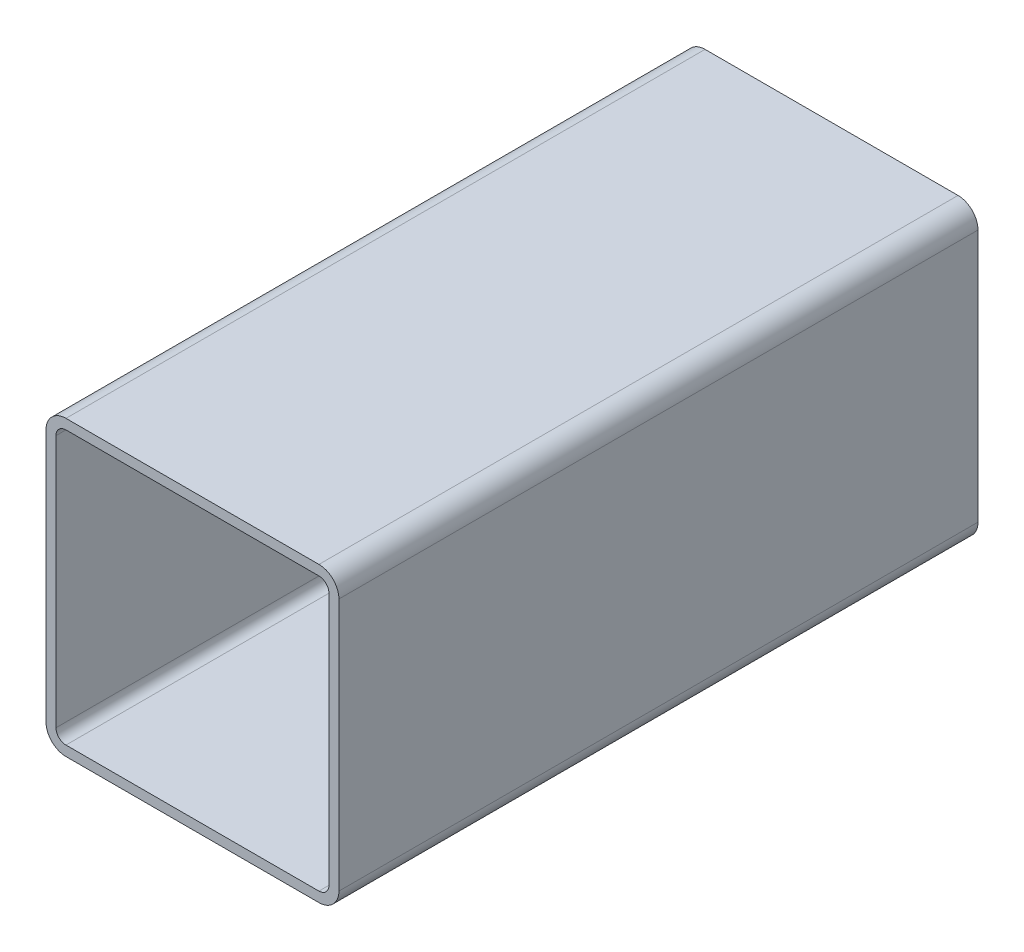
ISO-10303-21;
HEADER;
FILE_DESCRIPTION(('STEP AP214'),'2;1');
FILE_NAME('part.step','',(''),(''),'','','');
FILE_SCHEMA(('AUTOMOTIVE_DESIGN { 1 0 10303 214 1 1 1 1 }'));
ENDSEC;
DATA;
#1=APPLICATION_CONTEXT('core data for automotive mechanical design processes');
#2=APPLICATION_PROTOCOL_DEFINITION('international standard','automotive_design',2000,#1);
#3=PRODUCT_CONTEXT('',#1,'mechanical');
#4=PRODUCT('Part','Part','',(#3));
#5=PRODUCT_RELATED_PRODUCT_CATEGORY('part','',(#4));
#6=PRODUCT_DEFINITION_FORMATION('','',#4);
#7=PRODUCT_DEFINITION_CONTEXT('part definition',#1,'design');
#8=PRODUCT_DEFINITION('design','',#6,#7);
#9=PRODUCT_DEFINITION_SHAPE('','',#8);
#10=(LENGTH_UNIT() NAMED_UNIT(*) SI_UNIT(.MILLI.,.METRE.));
#11=(NAMED_UNIT(*) PLANE_ANGLE_UNIT() SI_UNIT($,.RADIAN.));
#12=(NAMED_UNIT(*) SI_UNIT($,.STERADIAN.) SOLID_ANGLE_UNIT());
#13=UNCERTAINTY_MEASURE_WITH_UNIT(LENGTH_MEASURE(1.E-05),#10,'distance_accuracy_value','');
#14=(GEOMETRIC_REPRESENTATION_CONTEXT(3) GLOBAL_UNCERTAINTY_ASSIGNED_CONTEXT((#13)) GLOBAL_UNIT_ASSIGNED_CONTEXT((#10,
#11,#12)) REPRESENTATION_CONTEXT('',''));
#15=CARTESIAN_POINT('',(0.,0.,0.));
#16=DIRECTION('',(0.,0.,1.));
#17=DIRECTION('',(1.,0.,0.));
#18=AXIS2_PLACEMENT_3D('',#15,#16,#17);
#19=CARTESIAN_POINT('',(9.97927050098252,130.930693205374,304.8));
#20=DIRECTION('',(0.,0.,1.));
#21=DIRECTION('',(1.,0.,0.));
#22=AXIS2_PLACEMENT_3D('',#19,#20,#21);
#23=PLANE('',#22);
#24=CARTESIAN_POINT('',(9.97927050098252,130.930693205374,304.8));
#25=DIRECTION('',(0.,0.,1.));
#26=DIRECTION('',(1.,0.,0.));
#27=AXIS2_PLACEMENT_3D('',#24,#25,#26);
#28=CIRCLE('',#27,9.52500000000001);
#29=CARTESIAN_POINT('',(9.97927050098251,140.455693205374,304.8));
#30=VERTEX_POINT('',#29);
#31=CARTESIAN_POINT('',(0.454270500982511,130.930693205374,304.8));
#32=VERTEX_POINT('',#31);
#33=EDGE_CURVE('E211',#30,#32,#28,.T.);
#34=ORIENTED_EDGE('',*,*,#33,.T.);
#35=DIRECTION('',(0.,-1.,0.));
#36=VECTOR('',#35,1.);
#37=CARTESIAN_POINT('',(0.454270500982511,130.930693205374,304.8));
#38=LINE('',#37,#36);
#39=CARTESIAN_POINT('',(0.45427050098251,10.2806932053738,304.8));
#40=VERTEX_POINT('',#39);
#41=EDGE_CURVE('E214',#32,#40,#38,.T.);
#42=ORIENTED_EDGE('',*,*,#41,.T.);
#43=CARTESIAN_POINT('',(9.97927050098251,10.2806932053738,304.8));
#44=DIRECTION('',(0.,0.,1.));
#45=DIRECTION('',(1.,0.,0.));
#46=AXIS2_PLACEMENT_3D('',#43,#44,#45);
#47=CIRCLE('',#46,9.525);
#48=CARTESIAN_POINT('',(9.97927050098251,0.755693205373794,304.8));
#49=VERTEX_POINT('',#48);
#50=EDGE_CURVE('E217',#40,#49,#47,.T.);
#51=ORIENTED_EDGE('',*,*,#50,.T.);
#52=DIRECTION('',(1.,0.,0.));
#53=VECTOR('',#52,1.);
#54=CARTESIAN_POINT('',(9.97927050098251,0.755693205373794,304.8));
#55=LINE('',#54,#53);
#56=CARTESIAN_POINT('',(130.629270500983,0.755693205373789,304.8));
#57=VERTEX_POINT('',#56);
#58=EDGE_CURVE('E219',#49,#57,#55,.T.);
#59=ORIENTED_EDGE('',*,*,#58,.T.);
#60=CARTESIAN_POINT('',(130.629270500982,10.2806932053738,304.8));
#61=DIRECTION('',(0.,0.,1.));
#62=DIRECTION('',(1.,0.,0.));
#63=AXIS2_PLACEMENT_3D('',#60,#61,#62);
#64=CIRCLE('',#63,9.525);
#65=CARTESIAN_POINT('',(140.154270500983,10.2806932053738,304.8));
#66=VERTEX_POINT('',#65);
#67=EDGE_CURVE('E221',#57,#66,#64,.T.);
#68=ORIENTED_EDGE('',*,*,#67,.T.);
#69=DIRECTION('',(0.,1.,0.));
#70=VECTOR('',#69,1.);
#71=CARTESIAN_POINT('',(140.154270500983,10.2806932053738,304.8));
#72=LINE('',#71,#70);
#73=CARTESIAN_POINT('',(140.154270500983,130.930693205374,304.8));
#74=VERTEX_POINT('',#73);
#75=EDGE_CURVE('E223',#66,#74,#72,.T.);
#76=ORIENTED_EDGE('',*,*,#75,.T.);
#77=CARTESIAN_POINT('',(130.629270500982,130.930693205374,304.8));
#78=DIRECTION('',(0.,0.,1.));
#79=DIRECTION('',(1.,0.,0.));
#80=AXIS2_PLACEMENT_3D('',#77,#78,#79);
#81=CIRCLE('',#80,9.52500000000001);
#82=CARTESIAN_POINT('',(130.629270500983,140.455693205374,304.8));
#83=VERTEX_POINT('',#82);
#84=EDGE_CURVE('E225',#74,#83,#81,.T.);
#85=ORIENTED_EDGE('',*,*,#84,.T.);
#86=DIRECTION('',(-1.,0.,0.));
#87=VECTOR('',#86,1.);
#88=CARTESIAN_POINT('',(130.629270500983,140.455693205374,304.8));
#89=LINE('',#88,#87);
#90=EDGE_CURVE('E227',#83,#30,#89,.T.);
#91=ORIENTED_EDGE('',*,*,#90,.T.);
#92=EDGE_LOOP('',(#34,#42,#51,#59,#68,#76,#85,#91));
#93=FACE_BOUND('',#92,.T.);
#94=DIRECTION('',(0.,-1.,0.));
#95=VECTOR('',#94,1.);
#96=CARTESIAN_POINT('',(5.21677050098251,10.2806932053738,304.8));
#97=LINE('',#96,#95);
#98=CARTESIAN_POINT('',(5.21677050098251,130.930693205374,304.8));
#99=VERTEX_POINT('',#98);
#100=CARTESIAN_POINT('',(5.21677050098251,10.2806932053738,304.8));
#101=VERTEX_POINT('',#100);
#102=EDGE_CURVE('E154',#99,#101,#97,.T.);
#103=ORIENTED_EDGE('',*,*,#102,.F.);
#104=CARTESIAN_POINT('',(9.97927050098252,130.930693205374,304.8));
#105=DIRECTION('',(0.,0.,1.));
#106=DIRECTION('',(1.,0.,0.));
#107=AXIS2_PLACEMENT_3D('',#104,#105,#106);
#108=CIRCLE('',#107,4.7625);
#109=CARTESIAN_POINT('',(9.97927050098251,135.693193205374,304.8));
#110=VERTEX_POINT('',#109);
#111=EDGE_CURVE('E146',#110,#99,#108,.T.);
#112=ORIENTED_EDGE('',*,*,#111,.F.);
#113=DIRECTION('',(-1.,0.,0.));
#114=VECTOR('',#113,1.);
#115=CARTESIAN_POINT('',(9.97927050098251,135.693193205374,304.8));
#116=LINE('',#115,#114);
#117=CARTESIAN_POINT('',(130.629270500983,135.693193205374,304.8));
#118=VERTEX_POINT('',#117);
#119=EDGE_CURVE('E179',#118,#110,#116,.T.);
#120=ORIENTED_EDGE('',*,*,#119,.F.);
#121=CARTESIAN_POINT('',(130.629270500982,130.930693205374,304.8));
#122=DIRECTION('',(0.,0.,1.));
#123=DIRECTION('',(1.,0.,0.));
#124=AXIS2_PLACEMENT_3D('',#121,#122,#123);
#125=CIRCLE('',#124,4.7625);
#126=CARTESIAN_POINT('',(135.391770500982,130.930693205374,304.8));
#127=VERTEX_POINT('',#126);
#128=EDGE_CURVE('E177',#127,#118,#125,.T.);
#129=ORIENTED_EDGE('',*,*,#128,.F.);
#130=DIRECTION('',(0.,1.,0.));
#131=VECTOR('',#130,1.);
#132=CARTESIAN_POINT('',(135.391770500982,130.930693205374,304.8));
#133=LINE('',#132,#131);
#134=CARTESIAN_POINT('',(135.391770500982,10.2806932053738,304.8));
#135=VERTEX_POINT('',#134);
#136=EDGE_CURVE('E175',#135,#127,#133,.T.);
#137=ORIENTED_EDGE('',*,*,#136,.F.);
#138=CARTESIAN_POINT('',(130.629270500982,10.2806932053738,304.8));
#139=DIRECTION('',(0.,0.,1.));
#140=DIRECTION('',(1.,0.,0.));
#141=AXIS2_PLACEMENT_3D('',#138,#139,#140);
#142=CIRCLE('',#141,4.7625);
#143=CARTESIAN_POINT('',(130.629270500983,5.51819320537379,304.8));
#144=VERTEX_POINT('',#143);
#145=EDGE_CURVE('E173',#144,#135,#142,.T.);
#146=ORIENTED_EDGE('',*,*,#145,.F.);
#147=DIRECTION('',(1.,0.,0.));
#148=VECTOR('',#147,1.);
#149=CARTESIAN_POINT('',(130.629270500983,5.51819320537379,304.8));
#150=LINE('',#149,#148);
#151=CARTESIAN_POINT('',(9.97927050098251,5.51819320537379,304.8));
#152=VERTEX_POINT('',#151);
#153=EDGE_CURVE('E169',#152,#144,#150,.T.);
#154=ORIENTED_EDGE('',*,*,#153,.F.);
#155=CARTESIAN_POINT('',(9.97927050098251,10.2806932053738,304.8));
#156=DIRECTION('',(0.,0.,1.));
#157=DIRECTION('',(1.,0.,0.));
#158=AXIS2_PLACEMENT_3D('',#155,#156,#157);
#159=CIRCLE('',#158,4.7625);
#160=EDGE_CURVE('E167',#101,#152,#159,.T.);
#161=ORIENTED_EDGE('',*,*,#160,.F.);
#162=EDGE_LOOP('',(#103,#112,#120,#129,#137,#146,#154,#161));
#163=FACE_BOUND('',#162,.T.);
#164=ADVANCED_FACE('F33',(#93,#163),#23,.T.);
#165=CARTESIAN_POINT('',(9.97927050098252,130.930693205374,0.));
#166=DIRECTION('',(0.,0.,1.));
#167=DIRECTION('',(1.,0.,0.));
#168=AXIS2_PLACEMENT_3D('',#165,#166,#167);
#169=PLANE('',#168);
#170=CARTESIAN_POINT('',(9.97927050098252,130.930693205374,0.));
#171=DIRECTION('',(0.,0.,1.));
#172=DIRECTION('',(1.,0.,0.));
#173=AXIS2_PLACEMENT_3D('',#170,#171,#172);
#174=CIRCLE('',#173,9.52500000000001);
#175=CARTESIAN_POINT('',(9.97927050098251,140.455693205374,0.));
#176=VERTEX_POINT('',#175);
#177=CARTESIAN_POINT('',(0.454270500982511,130.930693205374,0.));
#178=VERTEX_POINT('',#177);
#179=EDGE_CURVE('E162',#176,#178,#174,.T.);
#180=ORIENTED_EDGE('',*,*,#179,.F.);
#181=DIRECTION('',(-1.,0.,0.));
#182=VECTOR('',#181,1.);
#183=CARTESIAN_POINT('',(130.629270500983,140.455693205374,0.));
#184=LINE('',#183,#182);
#185=CARTESIAN_POINT('',(130.629270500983,140.455693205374,0.));
#186=VERTEX_POINT('',#185);
#187=EDGE_CURVE('E215',#186,#176,#184,.T.);
#188=ORIENTED_EDGE('',*,*,#187,.F.);
#189=CARTESIAN_POINT('',(130.629270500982,130.930693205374,0.));
#190=DIRECTION('',(0.,0.,1.));
#191=DIRECTION('',(1.,0.,0.));
#192=AXIS2_PLACEMENT_3D('',#189,#190,#191);
#193=CIRCLE('',#192,9.52500000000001);
#194=CARTESIAN_POINT('',(140.154270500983,130.930693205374,0.));
#195=VERTEX_POINT('',#194);
#196=EDGE_CURVE('E242',#195,#186,#193,.T.);
#197=ORIENTED_EDGE('',*,*,#196,.F.);
#198=DIRECTION('',(0.,1.,0.));
#199=VECTOR('',#198,1.);
#200=CARTESIAN_POINT('',(140.154270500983,10.2806932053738,0.));
#201=LINE('',#200,#199);
#202=CARTESIAN_POINT('',(140.154270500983,10.2806932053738,0.));
#203=VERTEX_POINT('',#202);
#204=EDGE_CURVE('E240',#203,#195,#201,.T.);
#205=ORIENTED_EDGE('',*,*,#204,.F.);
#206=CARTESIAN_POINT('',(130.629270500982,10.2806932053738,0.));
#207=DIRECTION('',(0.,0.,1.));
#208=DIRECTION('',(1.,0.,0.));
#209=AXIS2_PLACEMENT_3D('',#206,#207,#208);
#210=CIRCLE('',#209,9.525);
#211=CARTESIAN_POINT('',(130.629270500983,0.755693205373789,0.));
#212=VERTEX_POINT('',#211);
#213=EDGE_CURVE('E238',#212,#203,#210,.T.);
#214=ORIENTED_EDGE('',*,*,#213,.F.);
#215=DIRECTION('',(1.,0.,0.));
#216=VECTOR('',#215,1.);
#217=CARTESIAN_POINT('',(9.97927050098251,0.755693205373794,0.));
#218=LINE('',#217,#216);
#219=CARTESIAN_POINT('',(9.97927050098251,0.755693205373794,0.));
#220=VERTEX_POINT('',#219);
#221=EDGE_CURVE('E236',#220,#212,#218,.T.);
#222=ORIENTED_EDGE('',*,*,#221,.F.);
#223=CARTESIAN_POINT('',(9.97927050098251,10.2806932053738,0.));
#224=DIRECTION('',(0.,0.,1.));
#225=DIRECTION('',(1.,0.,0.));
#226=AXIS2_PLACEMENT_3D('',#223,#224,#225);
#227=CIRCLE('',#226,9.525);
#228=CARTESIAN_POINT('',(0.45427050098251,10.2806932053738,0.));
#229=VERTEX_POINT('',#228);
#230=EDGE_CURVE('E234',#229,#220,#227,.T.);
#231=ORIENTED_EDGE('',*,*,#230,.F.);
#232=DIRECTION('',(0.,-1.,0.));
#233=VECTOR('',#232,1.);
#234=CARTESIAN_POINT('',(0.454270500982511,130.930693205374,0.));
#235=LINE('',#234,#233);
#236=EDGE_CURVE('E232',#178,#229,#235,.T.);
#237=ORIENTED_EDGE('',*,*,#236,.F.);
#238=EDGE_LOOP('',(#180,#188,#197,#205,#214,#222,#231,#237));
#239=FACE_BOUND('',#238,.T.);
#240=CARTESIAN_POINT('',(9.97927050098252,130.930693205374,0.));
#241=DIRECTION('',(0.,0.,1.));
#242=DIRECTION('',(1.,0.,0.));
#243=AXIS2_PLACEMENT_3D('',#240,#241,#242);
#244=CIRCLE('',#243,4.7625);
#245=CARTESIAN_POINT('',(9.97927050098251,135.693193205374,0.));
#246=VERTEX_POINT('',#245);
#247=CARTESIAN_POINT('',(5.21677050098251,130.930693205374,0.));
#248=VERTEX_POINT('',#247);
#249=EDGE_CURVE('E56',#246,#248,#244,.T.);
#250=ORIENTED_EDGE('',*,*,#249,.T.);
#251=DIRECTION('',(0.,-1.,0.));
#252=VECTOR('',#251,1.);
#253=CARTESIAN_POINT('',(5.21677050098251,10.2806932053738,0.));
#254=LINE('',#253,#252);
#255=CARTESIAN_POINT('',(5.21677050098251,10.2806932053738,0.));
#256=VERTEX_POINT('',#255);
#257=EDGE_CURVE('E161',#248,#256,#254,.T.);
#258=ORIENTED_EDGE('',*,*,#257,.T.);
#259=CARTESIAN_POINT('',(9.97927050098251,10.2806932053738,0.));
#260=DIRECTION('',(0.,0.,1.));
#261=DIRECTION('',(1.,0.,0.));
#262=AXIS2_PLACEMENT_3D('',#259,#260,#261);
#263=CIRCLE('',#262,4.7625);
#264=CARTESIAN_POINT('',(9.97927050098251,5.51819320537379,0.));
#265=VERTEX_POINT('',#264);
#266=EDGE_CURVE('E183',#256,#265,#263,.T.);
#267=ORIENTED_EDGE('',*,*,#266,.T.);
#268=DIRECTION('',(1.,0.,0.));
#269=VECTOR('',#268,1.);
#270=CARTESIAN_POINT('',(130.629270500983,5.51819320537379,0.));
#271=LINE('',#270,#269);
#272=CARTESIAN_POINT('',(130.629270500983,5.51819320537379,0.));
#273=VERTEX_POINT('',#272);
#274=EDGE_CURVE('E186',#265,#273,#271,.T.);
#275=ORIENTED_EDGE('',*,*,#274,.T.);
#276=CARTESIAN_POINT('',(130.629270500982,10.2806932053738,0.));
#277=DIRECTION('',(0.,0.,1.));
#278=DIRECTION('',(1.,0.,0.));
#279=AXIS2_PLACEMENT_3D('',#276,#277,#278);
#280=CIRCLE('',#279,4.7625);
#281=CARTESIAN_POINT('',(135.391770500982,10.2806932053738,0.));
#282=VERTEX_POINT('',#281);
#283=EDGE_CURVE('E189',#273,#282,#280,.T.);
#284=ORIENTED_EDGE('',*,*,#283,.T.);
#285=DIRECTION('',(0.,1.,0.));
#286=VECTOR('',#285,1.);
#287=CARTESIAN_POINT('',(135.391770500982,130.930693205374,0.));
#288=LINE('',#287,#286);
#289=CARTESIAN_POINT('',(135.391770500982,130.930693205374,0.));
#290=VERTEX_POINT('',#289);
#291=EDGE_CURVE('E192',#282,#290,#288,.T.);
#292=ORIENTED_EDGE('',*,*,#291,.T.);
#293=CARTESIAN_POINT('',(130.629270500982,130.930693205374,0.));
#294=DIRECTION('',(0.,0.,1.));
#295=DIRECTION('',(1.,0.,0.));
#296=AXIS2_PLACEMENT_3D('',#293,#294,#295);
#297=CIRCLE('',#296,4.7625);
#298=CARTESIAN_POINT('',(130.629270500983,135.693193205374,0.));
#299=VERTEX_POINT('',#298);
#300=EDGE_CURVE('E195',#290,#299,#297,.T.);
#301=ORIENTED_EDGE('',*,*,#300,.T.);
#302=DIRECTION('',(-1.,0.,0.));
#303=VECTOR('',#302,1.);
#304=CARTESIAN_POINT('',(9.97927050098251,135.693193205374,0.));
#305=LINE('',#304,#303);
#306=EDGE_CURVE('E155',#299,#246,#305,.T.);
#307=ORIENTED_EDGE('',*,*,#306,.T.);
#308=EDGE_LOOP('',(#250,#258,#267,#275,#284,#292,#301,#307));
#309=FACE_BOUND('',#308,.T.);
#310=ADVANCED_FACE('F272',(#239,#309),#169,.F.);
#311=CARTESIAN_POINT('',(9.97927050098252,130.930693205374,304.8));
#312=DIRECTION('',(0.,0.,-1.));
#313=DIRECTION('',(-1.,0.,0.));
#314=AXIS2_PLACEMENT_3D('',#311,#312,#313);
#315=CYLINDRICAL_SURFACE('',#314,9.52500000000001);
#316=ORIENTED_EDGE('',*,*,#179,.T.);
#317=DIRECTION('',(0.,0.,-1.));
#318=VECTOR('',#317,1.);
#319=CARTESIAN_POINT('',(0.454270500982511,130.930693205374,304.8));
#320=LINE('',#319,#318);
#321=EDGE_CURVE('E11',#32,#178,#320,.T.);
#322=ORIENTED_EDGE('',*,*,#321,.F.);
#323=ORIENTED_EDGE('',*,*,#33,.F.);
#324=DIRECTION('',(0.,0.,-1.));
#325=VECTOR('',#324,1.);
#326=CARTESIAN_POINT('',(9.97927050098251,140.455693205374,304.8));
#327=LINE('',#326,#325);
#328=EDGE_CURVE('E229',#30,#176,#327,.T.);
#329=ORIENTED_EDGE('',*,*,#328,.T.);
#330=EDGE_LOOP('',(#316,#322,#323,#329));
#331=FACE_BOUND('',#330,.T.);
#332=ADVANCED_FACE('F35',(#331),#315,.T.);
#333=CARTESIAN_POINT('',(0.454270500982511,130.930693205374,304.8));
#334=DIRECTION('',(1.,0.,0.));
#335=DIRECTION('',(0.,0.,-1.));
#336=AXIS2_PLACEMENT_3D('',#333,#334,#335);
#337=PLANE('',#336);
#338=ORIENTED_EDGE('',*,*,#236,.T.);
#339=DIRECTION('',(0.,0.,-1.));
#340=VECTOR('',#339,1.);
#341=CARTESIAN_POINT('',(0.45427050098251,10.2806932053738,304.8));
#342=LINE('',#341,#340);
#343=EDGE_CURVE('E41',#40,#229,#342,.T.);
#344=ORIENTED_EDGE('',*,*,#343,.F.);
#345=ORIENTED_EDGE('',*,*,#41,.F.);
#346=ORIENTED_EDGE('',*,*,#321,.T.);
#347=EDGE_LOOP('',(#338,#344,#345,#346));
#348=FACE_BOUND('',#347,.T.);
#349=ADVANCED_FACE('F289',(#348),#337,.F.);
#350=CARTESIAN_POINT('',(9.97927050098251,10.2806932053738,304.8));
#351=DIRECTION('',(0.,0.,-1.));
#352=DIRECTION('',(-1.,0.,0.));
#353=AXIS2_PLACEMENT_3D('',#350,#351,#352);
#354=CYLINDRICAL_SURFACE('',#353,9.525);
#355=ORIENTED_EDGE('',*,*,#230,.T.);
#356=DIRECTION('',(0.,0.,-1.));
#357=VECTOR('',#356,1.);
#358=CARTESIAN_POINT('',(9.97927050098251,0.755693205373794,304.8));
#359=LINE('',#358,#357);
#360=EDGE_CURVE('E259',#49,#220,#359,.T.);
#361=ORIENTED_EDGE('',*,*,#360,.F.);
#362=ORIENTED_EDGE('',*,*,#50,.F.);
#363=ORIENTED_EDGE('',*,*,#343,.T.);
#364=EDGE_LOOP('',(#355,#361,#362,#363));
#365=FACE_BOUND('',#364,.T.);
#366=ADVANCED_FACE('F266',(#365),#354,.T.);
#367=CARTESIAN_POINT('',(9.97927050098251,0.755693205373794,304.8));
#368=DIRECTION('',(0.,1.,0.));
#369=DIRECTION('',(0.,0.,1.));
#370=AXIS2_PLACEMENT_3D('',#367,#368,#369);
#371=PLANE('',#370);
#372=ORIENTED_EDGE('',*,*,#221,.T.);
#373=DIRECTION('',(0.,0.,-1.));
#374=VECTOR('',#373,1.);
#375=CARTESIAN_POINT('',(130.629270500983,0.755693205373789,304.8));
#376=LINE('',#375,#374);
#377=EDGE_CURVE('E256',#57,#212,#376,.T.);
#378=ORIENTED_EDGE('',*,*,#377,.F.);
#379=ORIENTED_EDGE('',*,*,#58,.F.);
#380=ORIENTED_EDGE('',*,*,#360,.T.);
#381=EDGE_LOOP('',(#372,#378,#379,#380));
#382=FACE_BOUND('',#381,.T.);
#383=ADVANCED_FACE('F278',(#382),#371,.F.);
#384=CARTESIAN_POINT('',(130.629270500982,10.2806932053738,304.8));
#385=DIRECTION('',(0.,0.,-1.));
#386=DIRECTION('',(-1.,0.,0.));
#387=AXIS2_PLACEMENT_3D('',#384,#385,#386);
#388=CYLINDRICAL_SURFACE('',#387,9.525);
#389=ORIENTED_EDGE('',*,*,#213,.T.);
#390=DIRECTION('',(0.,0.,-1.));
#391=VECTOR('',#390,1.);
#392=CARTESIAN_POINT('',(140.154270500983,10.2806932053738,304.8));
#393=LINE('',#392,#391);
#394=EDGE_CURVE('E253',#66,#203,#393,.T.);
#395=ORIENTED_EDGE('',*,*,#394,.F.);
#396=ORIENTED_EDGE('',*,*,#67,.F.);
#397=ORIENTED_EDGE('',*,*,#377,.T.);
#398=EDGE_LOOP('',(#389,#395,#396,#397));
#399=FACE_BOUND('',#398,.T.);
#400=ADVANCED_FACE('F282',(#399),#388,.T.);
#401=CARTESIAN_POINT('',(140.154270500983,10.2806932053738,304.8));
#402=DIRECTION('',(-1.,0.,0.));
#403=DIRECTION('',(0.,0.,1.));
#404=AXIS2_PLACEMENT_3D('',#401,#402,#403);
#405=PLANE('',#404);
#406=ORIENTED_EDGE('',*,*,#204,.T.);
#407=DIRECTION('',(0.,0.,-1.));
#408=VECTOR('',#407,1.);
#409=CARTESIAN_POINT('',(140.154270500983,130.930693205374,304.8));
#410=LINE('',#409,#408);
#411=EDGE_CURVE('E250',#74,#195,#410,.T.);
#412=ORIENTED_EDGE('',*,*,#411,.F.);
#413=ORIENTED_EDGE('',*,*,#75,.F.);
#414=ORIENTED_EDGE('',*,*,#394,.T.);
#415=EDGE_LOOP('',(#406,#412,#413,#414));
#416=FACE_BOUND('',#415,.T.);
#417=ADVANCED_FACE('F302',(#416),#405,.F.);
#418=CARTESIAN_POINT('',(130.629270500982,130.930693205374,304.8));
#419=DIRECTION('',(0.,0.,-1.));
#420=DIRECTION('',(-1.,0.,0.));
#421=AXIS2_PLACEMENT_3D('',#418,#419,#420);
#422=CYLINDRICAL_SURFACE('',#421,9.52500000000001);
#423=ORIENTED_EDGE('',*,*,#196,.T.);
#424=DIRECTION('',(0.,0.,-1.));
#425=VECTOR('',#424,1.);
#426=CARTESIAN_POINT('',(130.629270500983,140.455693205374,304.8));
#427=LINE('',#426,#425);
#428=EDGE_CURVE('E247',#83,#186,#427,.T.);
#429=ORIENTED_EDGE('',*,*,#428,.F.);
#430=ORIENTED_EDGE('',*,*,#84,.F.);
#431=ORIENTED_EDGE('',*,*,#411,.T.);
#432=EDGE_LOOP('',(#423,#429,#430,#431));
#433=FACE_BOUND('',#432,.T.);
#434=ADVANCED_FACE('F300',(#433),#422,.T.);
#435=CARTESIAN_POINT('',(130.629270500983,140.455693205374,304.8));
#436=DIRECTION('',(0.,-1.,0.));
#437=DIRECTION('',(0.,0.,-1.));
#438=AXIS2_PLACEMENT_3D('',#435,#436,#437);
#439=PLANE('',#438);
#440=ORIENTED_EDGE('',*,*,#187,.T.);
#441=ORIENTED_EDGE('',*,*,#328,.F.);
#442=ORIENTED_EDGE('',*,*,#90,.F.);
#443=ORIENTED_EDGE('',*,*,#428,.T.);
#444=EDGE_LOOP('',(#440,#441,#442,#443));
#445=FACE_BOUND('',#444,.T.);
#446=ADVANCED_FACE('F295',(#445),#439,.F.);
#447=CARTESIAN_POINT('',(9.97927050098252,130.930693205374,304.8));
#448=DIRECTION('',(0.,0.,-1.));
#449=DIRECTION('',(-1.,0.,0.));
#450=AXIS2_PLACEMENT_3D('',#447,#448,#449);
#451=CYLINDRICAL_SURFACE('',#450,4.7625);
#452=ORIENTED_EDGE('',*,*,#249,.F.);
#453=DIRECTION('',(0.,0.,-1.));
#454=VECTOR('',#453,1.);
#455=CARTESIAN_POINT('',(9.97927050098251,135.693193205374,304.8));
#456=LINE('',#455,#454);
#457=EDGE_CURVE('E150',#110,#246,#456,.T.);
#458=ORIENTED_EDGE('',*,*,#457,.F.);
#459=ORIENTED_EDGE('',*,*,#111,.T.);
#460=DIRECTION('',(0.,0.,-1.));
#461=VECTOR('',#460,1.);
#462=CARTESIAN_POINT('',(5.21677050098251,130.930693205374,304.8));
#463=LINE('',#462,#461);
#464=EDGE_CURVE('E149',#99,#248,#463,.T.);
#465=ORIENTED_EDGE('',*,*,#464,.T.);
#466=EDGE_LOOP('',(#452,#458,#459,#465));
#467=FACE_BOUND('',#466,.T.);
#468=ADVANCED_FACE('F148',(#467),#451,.F.);
#469=CARTESIAN_POINT('',(5.21677050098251,10.2806932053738,304.8));
#470=DIRECTION('',(1.,0.,0.));
#471=DIRECTION('',(0.,0.,-1.));
#472=AXIS2_PLACEMENT_3D('',#469,#470,#471);
#473=PLANE('',#472);
#474=ORIENTED_EDGE('',*,*,#257,.F.);
#475=ORIENTED_EDGE('',*,*,#464,.F.);
#476=ORIENTED_EDGE('',*,*,#102,.T.);
#477=DIRECTION('',(0.,0.,-1.));
#478=VECTOR('',#477,1.);
#479=CARTESIAN_POINT('',(5.21677050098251,10.2806932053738,304.8));
#480=LINE('',#479,#478);
#481=EDGE_CURVE('E163',#101,#256,#480,.T.);
#482=ORIENTED_EDGE('',*,*,#481,.T.);
#483=EDGE_LOOP('',(#474,#475,#476,#482));
#484=FACE_BOUND('',#483,.T.);
#485=ADVANCED_FACE('F158',(#484),#473,.T.);
#486=CARTESIAN_POINT('',(9.97927050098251,10.2806932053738,304.8));
#487=DIRECTION('',(0.,0.,-1.));
#488=DIRECTION('',(-1.,0.,0.));
#489=AXIS2_PLACEMENT_3D('',#486,#487,#488);
#490=CYLINDRICAL_SURFACE('',#489,4.7625);
#491=ORIENTED_EDGE('',*,*,#266,.F.);
#492=ORIENTED_EDGE('',*,*,#481,.F.);
#493=ORIENTED_EDGE('',*,*,#160,.T.);
#494=DIRECTION('',(0.,0.,-1.));
#495=VECTOR('',#494,1.);
#496=CARTESIAN_POINT('',(9.97927050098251,5.51819320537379,304.8));
#497=LINE('',#496,#495);
#498=EDGE_CURVE('E208',#152,#265,#497,.T.);
#499=ORIENTED_EDGE('',*,*,#498,.T.);
#500=EDGE_LOOP('',(#491,#492,#493,#499));
#501=FACE_BOUND('',#500,.T.);
#502=ADVANCED_FACE('F327',(#501),#490,.F.);
#503=CARTESIAN_POINT('',(130.629270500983,5.51819320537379,304.8));
#504=DIRECTION('',(0.,1.,0.));
#505=DIRECTION('',(0.,0.,1.));
#506=AXIS2_PLACEMENT_3D('',#503,#504,#505);
#507=PLANE('',#506);
#508=ORIENTED_EDGE('',*,*,#274,.F.);
#509=ORIENTED_EDGE('',*,*,#498,.F.);
#510=ORIENTED_EDGE('',*,*,#153,.T.);
#511=DIRECTION('',(0.,0.,-1.));
#512=VECTOR('',#511,1.);
#513=CARTESIAN_POINT('',(130.629270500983,5.51819320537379,304.8));
#514=LINE('',#513,#512);
#515=EDGE_CURVE('E206',#144,#273,#514,.T.);
#516=ORIENTED_EDGE('',*,*,#515,.T.);
#517=EDGE_LOOP('',(#508,#509,#510,#516));
#518=FACE_BOUND('',#517,.T.);
#519=ADVANCED_FACE('F331',(#518),#507,.T.);
#520=CARTESIAN_POINT('',(130.629270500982,10.2806932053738,304.8));
#521=DIRECTION('',(0.,0.,-1.));
#522=DIRECTION('',(-1.,0.,0.));
#523=AXIS2_PLACEMENT_3D('',#520,#521,#522);
#524=CYLINDRICAL_SURFACE('',#523,4.7625);
#525=ORIENTED_EDGE('',*,*,#283,.F.);
#526=ORIENTED_EDGE('',*,*,#515,.F.);
#527=ORIENTED_EDGE('',*,*,#145,.T.);
#528=DIRECTION('',(0.,0.,-1.));
#529=VECTOR('',#528,1.);
#530=CARTESIAN_POINT('',(135.391770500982,10.2806932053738,304.8));
#531=LINE('',#530,#529);
#532=EDGE_CURVE('E204',#135,#282,#531,.T.);
#533=ORIENTED_EDGE('',*,*,#532,.T.);
#534=EDGE_LOOP('',(#525,#526,#527,#533));
#535=FACE_BOUND('',#534,.T.);
#536=ADVANCED_FACE('F337',(#535),#524,.F.);
#537=CARTESIAN_POINT('',(135.391770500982,130.930693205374,304.8));
#538=DIRECTION('',(-1.,0.,0.));
#539=DIRECTION('',(0.,0.,1.));
#540=AXIS2_PLACEMENT_3D('',#537,#538,#539);
#541=PLANE('',#540);
#542=ORIENTED_EDGE('',*,*,#291,.F.);
#543=ORIENTED_EDGE('',*,*,#532,.F.);
#544=ORIENTED_EDGE('',*,*,#136,.T.);
#545=DIRECTION('',(0.,0.,-1.));
#546=VECTOR('',#545,1.);
#547=CARTESIAN_POINT('',(135.391770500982,130.930693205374,304.8));
#548=LINE('',#547,#546);
#549=EDGE_CURVE('E202',#127,#290,#548,.T.);
#550=ORIENTED_EDGE('',*,*,#549,.T.);
#551=EDGE_LOOP('',(#542,#543,#544,#550));
#552=FACE_BOUND('',#551,.T.);
#553=ADVANCED_FACE('F341',(#552),#541,.T.);
#554=CARTESIAN_POINT('',(130.629270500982,130.930693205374,304.8));
#555=DIRECTION('',(0.,0.,-1.));
#556=DIRECTION('',(-1.,0.,0.));
#557=AXIS2_PLACEMENT_3D('',#554,#555,#556);
#558=CYLINDRICAL_SURFACE('',#557,4.7625);
#559=ORIENTED_EDGE('',*,*,#300,.F.);
#560=ORIENTED_EDGE('',*,*,#549,.F.);
#561=ORIENTED_EDGE('',*,*,#128,.T.);
#562=DIRECTION('',(0.,0.,-1.));
#563=VECTOR('',#562,1.);
#564=CARTESIAN_POINT('',(130.629270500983,135.693193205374,304.8));
#565=LINE('',#564,#563);
#566=EDGE_CURVE('E48',#118,#299,#565,.T.);
#567=ORIENTED_EDGE('',*,*,#566,.T.);
#568=EDGE_LOOP('',(#559,#560,#561,#567));
#569=FACE_BOUND('',#568,.T.);
#570=ADVANCED_FACE('F345',(#569),#558,.F.);
#571=CARTESIAN_POINT('',(9.97927050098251,135.693193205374,304.8));
#572=DIRECTION('',(0.,-1.,0.));
#573=DIRECTION('',(0.,0.,-1.));
#574=AXIS2_PLACEMENT_3D('',#571,#572,#573);
#575=PLANE('',#574);
#576=ORIENTED_EDGE('',*,*,#306,.F.);
#577=ORIENTED_EDGE('',*,*,#566,.F.);
#578=ORIENTED_EDGE('',*,*,#119,.T.);
#579=ORIENTED_EDGE('',*,*,#457,.T.);
#580=EDGE_LOOP('',(#576,#577,#578,#579));
#581=FACE_BOUND('',#580,.T.);
#582=ADVANCED_FACE('F349',(#581),#575,.T.);
#583=CLOSED_SHELL('',(#164,#310,#332,#349,#366,#383,#400,#417,#434,#446,#468,#485,#502,#519,
#536,#553,#570,#582));
#584=MANIFOLD_SOLID_BREP('B2',#583);
#585=ADVANCED_BREP_SHAPE_REPRESENTATION('',(#18,#584),#14);
#586=SHAPE_DEFINITION_REPRESENTATION(#9,#585);
ENDSEC;
END-ISO-10303-21;
